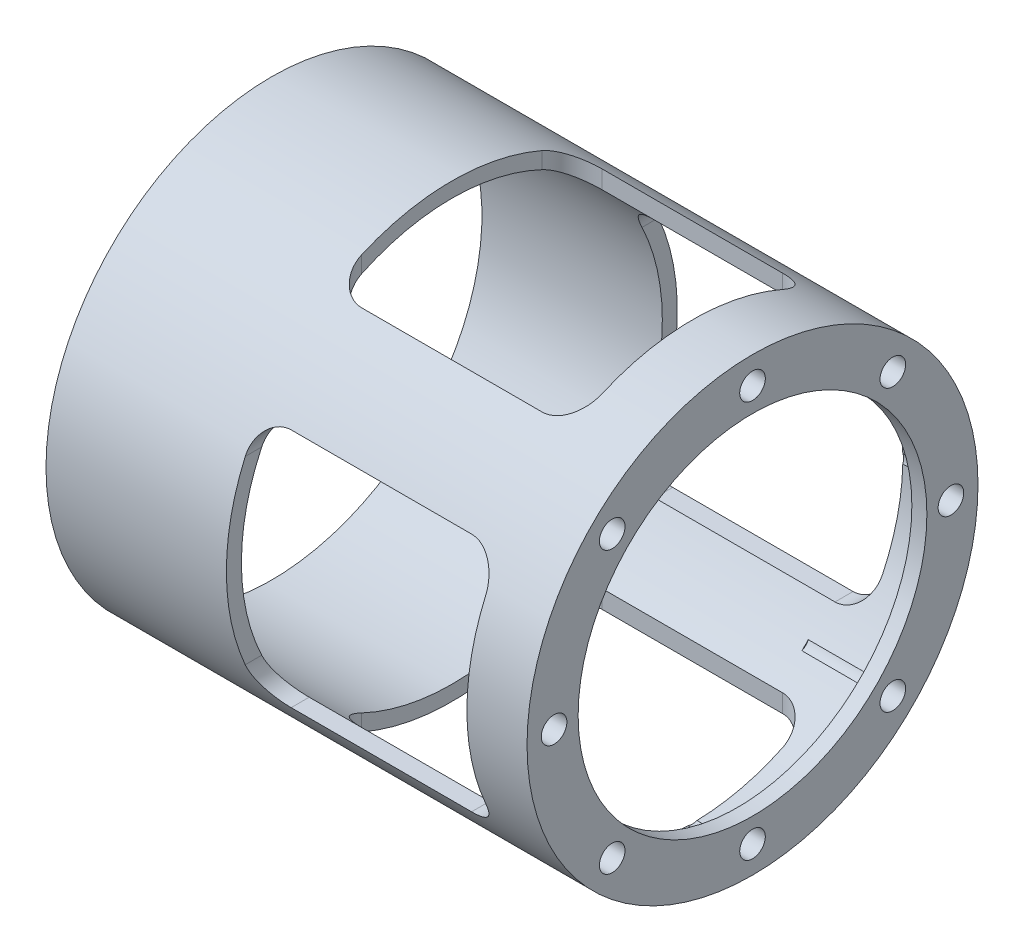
from build123d import *

# Parameters (mm, degrees)
SKETCH2_R          = 1.35255
CUT_EXTRUDE1_DEPTH = 10.16
CIRPATTERN1_COUNT  = 8
CUT_EXTRUDE2_DEPTH = 61.948423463
CIRPATTERN2_COUNT  = 4


with BuildPart() as part:
    # Sketch1 → Revolve1 (revolve)
    with BuildSketch(Plane.XY, mode=Mode.PRIVATE) as revolve1_sk:
        Polygon((19.05, 23.8125), (0, 23.8125), (0, 22.225), (47.012795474, 22.225), (49.2125, 18.415), (50.8, 18.415), (50.8, 23.8125), align=None)
    revolve(revolve1_sk.sketch.rotate(Axis((-44.527352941, 0, 0), (1, 0, 0)), 90), axis=Axis((-44.527352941, 0, 0), (1, 0, 0)))

    # Sketch2 → Cut-Extrude1 (cut)
    with BuildSketch(Plane(origin=(50.8, 0, 0), x_dir=(0, 0, -1), z_dir=(1, 0, 0))):
        with Locations((0, 20.955)):
            Circle(SKETCH2_R)
    cut_extrude1 = extrude(amount=-CUT_EXTRUDE1_DEPTH, mode=Mode.SUBTRACT)

    # CirPattern1: Cut-Extrude1 ×8 about axis
    cirpattern1_axis = Axis((0, 0, 0), (1, 0, 0))
    for i in range(1, CIRPATTERN1_COUNT):
        add(cut_extrude1.rotate(cirpattern1_axis, i * 360 / CIRPATTERN1_COUNT), mode=Mode.SUBTRACT)

    # Sketch4 → Cut-Extrude2 (cut, through all)
    with BuildSketch(Plane(origin=(0, 0, 0), x_dir=(1, 0, 0), z_dir=(0, 1, 0))):
        with BuildLine():
            Line((22.225, -12.7), (41.275, -12.7))
            ThreePointArc((41.275, -12.7), (43.52006403, -11.77006403), (44.45, -9.525))
            Line((44.45, -9.525), (44.45, 9.525))
            ThreePointArc((44.45, 9.525), (43.52006403, 11.77006403), (41.275, 12.7))
            Line((41.275, 12.7), (22.225, 12.7))
            ThreePointArc((22.225, 12.7), (19.97993597, 11.77006403), (19.05, 9.525))
            Line((19.05, 9.525), (19.05, -9.525))
            ThreePointArc((19.05, -9.525), (19.97993597, -11.77006403), (22.225, -12.7))
        make_face()
    cut_extrude2 = extrude(amount=-CUT_EXTRUDE2_DEPTH, mode=Mode.SUBTRACT)

    # CirPattern2: Cut-Extrude2 ×4 about axis
    cirpattern2_axis = Axis((0, 0, 0), (1, 0, 0))
    for i in range(1, CIRPATTERN2_COUNT):
        add(cut_extrude2.rotate(cirpattern2_axis, i * 360 / CIRPATTERN2_COUNT), mode=Mode.SUBTRACT)


solid = part.part
